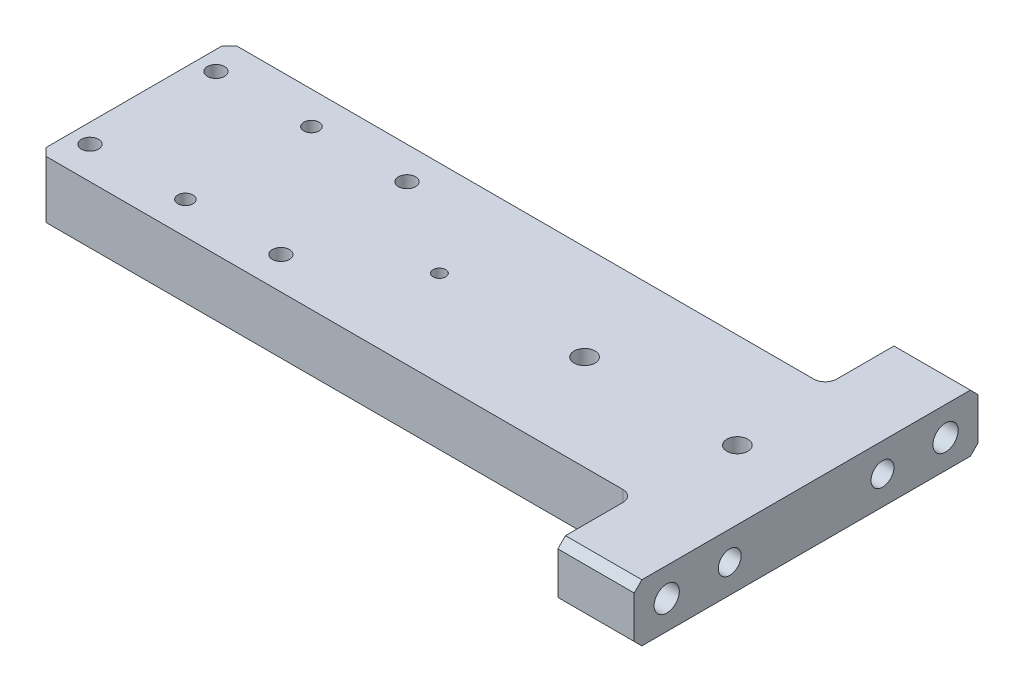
from build123d import *

# Parameters (mm, degrees)
SKETCH_1_W                   = 176
SKETCH_1_H                   = 90
EXTRUDE_1_DEPTH              = 15
HOLE_WIZARD_M4_1_D           = 4.5
HOLE_WIZARD_M4_1_CBORE_D     = 8
HOLE_WIZARD_M4_1_CBORE_DEPTH = 4.6
F_4_0MM_1_D                  = 4
F_4_0MM_1_DEPTH              = 5
HOLE_WIZARD_M4_3_D           = 3.3
SKETCH_49_W                  = 212.979037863
SKETCH_49_H                  = 40.618412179
SKETCH_49_H_2                = 63.761491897
CUT_EXTRUDE_3_DEPTH          = 100.969995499
HOLE_WIZARD_M6_2_D           = 6.6
F_6_0MM_1_D                  = 6
F_6_0MM_1_DEPTH              = 5
HOLE_WIZARD_M4_4_D           = 3.3
HOLE_WIZARD_M4_4_DEPTH       = 8
HOLE_WIZARD_M4_4_TIP         = 0.991420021
HOLE_WIZARD_M4_5_D           = 3.3
HOLE_WIZARD_M4_5_DEPTH       = 10.1
HOLE_WIZARD_M4_5_TIP         = 0.991420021
FILLET_2_R                   = 3
CHAMFER_4_SIZE               = 2
HOLE_WIZARD_M5_1_D           = 5.5
HOLE_WIZARD_M5_1_CBORE_D     = 10
HOLE_WIZARD_M5_1_CBORE_DEPTH = 5.4


with BuildPart() as part:
    # Sketch 1 → Extrude 1 (new body)
    with BuildSketch(Plane(origin=(0, 0, 0), x_dir=(1, 0, 0), z_dir=(0, 1, 0))):
        Rectangle(SKETCH_1_W, SKETCH_1_H)
    extrude(amount=EXTRUDE_1_DEPTH)

    # Hole Wizard M4 _1 (through all)
    with Locations(Plane(origin=(0, 0, 0), x_dir=(-1, 0, 0), z_dir=(0, -1, 0))):
        with Locations((83, 16.5), (83, -16.5), (33, 16.5), (33, -16.5)):
            CounterBoreHole(HOLE_WIZARD_M4_1_D / 2, HOLE_WIZARD_M4_1_CBORE_D / 2, HOLE_WIZARD_M4_1_CBORE_DEPTH)

    # 4.0mm _1
    with Locations(Plane(origin=(0, 15, 0), x_dir=(1, 0, 0), z_dir=(0, 1, 0))):
        with Locations((-58, -16.5), (-58, 16.5)):
            Hole(F_4_0MM_1_D / 2, depth=F_4_0MM_1_DEPTH)

    # Hole Wizard M4 _3 (through all)
    with Locations(Plane(origin=(0, 15, 0), x_dir=(1, 0, 0), z_dir=(0, 1, 0))):
        with Locations((-8, 0)):
            Hole(HOLE_WIZARD_M4_3_D / 2)

    # Sketch 49 → Cut-Extrude 3 (cut, through all)
    with BuildSketch(Plane(origin=(0, 15, 0), x_dir=(1, 0, 0), z_dir=(0, 1, 0))):
        with Locations((-38.489518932, -45.30920609)):
            Rectangle(SKETCH_49_W, SKETCH_49_H)
        with Locations((-38.489518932, 56.880745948)):
            Rectangle(SKETCH_49_W, SKETCH_49_H_2)
    extrude(amount=-CUT_EXTRUDE_3_DEPTH, mode=Mode.SUBTRACT)

    # Hole Wizard M6 _2 (through all)
    with Locations(Plane.ZY.offset(-68)):
        with Locations((36.5, 7.5), (-36.5, 7.5)):
            Hole(HOLE_WIZARD_M6_2_D / 2)

    # 6.0mm _1
    with Locations(Plane(origin=(88, 0, 0), x_dir=(0, 0, -1), z_dir=(1, 0, 0))):
        with Locations((-20, 7.5), (20, 7.5)):
            Hole(F_6_0MM_1_D / 2, depth=F_6_0MM_1_DEPTH)

    # Hole Wizard M4 _4
    with Locations(Plane(origin=(0, 0, 0), x_dir=(-1, 0, 0), z_dir=(0, -1, 0))):
        with Locations((30, 6), (45, 6)):
            Hole(HOLE_WIZARD_M4_4_D / 2, depth=HOLE_WIZARD_M4_4_DEPTH)
            with Locations((0, 0, -(HOLE_WIZARD_M4_4_DEPTH + HOLE_WIZARD_M4_4_TIP / 2))):  # 118° drill point
                Cone(0, HOLE_WIZARD_M4_4_D / 2, HOLE_WIZARD_M4_4_TIP, mode=Mode.SUBTRACT)

    # Hole Wizard M4 _5
    with Locations(Plane(origin=(0, 0, -25), x_dir=(-1, 0, 0), z_dir=(0, 0, -1))):
        with Locations((13, 7.5)):
            Hole(HOLE_WIZARD_M4_5_D / 2, depth=HOLE_WIZARD_M4_5_DEPTH)
            with Locations((0, 0, -(HOLE_WIZARD_M4_5_DEPTH + HOLE_WIZARD_M4_5_TIP / 2))):  # 118° drill point
                Cone(0, HOLE_WIZARD_M4_5_D / 2, HOLE_WIZARD_M4_5_TIP, mode=Mode.SUBTRACT)

    # Fillet 2
    fillet_2_edges = [part.edges().sort_by_distance(p)[0] for p in [
        (68, 7.5, 25),
        (68, 7.5, -25),
    ]]
    fillet(fillet_2_edges, radius=FILLET_2_R)

    # Chamfer 4
    chamfer_4_edges = [part.edges().sort_by_distance(p)[0] for p in [
        (78, 0, -45),
        (78, 0, 45),
        (78, 15, 45),
        (-88, 7.5, 25),
        (78, 15, -45),
        (-88, 7.5, -25),
    ]]
    chamfer(chamfer_4_edges, length=CHAMFER_4_SIZE)

    # Hole Wizard M5 _1 (through all)
    with Locations(Plane(origin=(0, 0, 0), x_dir=(-1, 0, 0), z_dir=(0, -1, 0))):
        with Locations((-70, 0), (-30, 0)):
            CounterBoreHole(HOLE_WIZARD_M5_1_D / 2, HOLE_WIZARD_M5_1_CBORE_D / 2, HOLE_WIZARD_M5_1_CBORE_DEPTH)


solid = part.part
